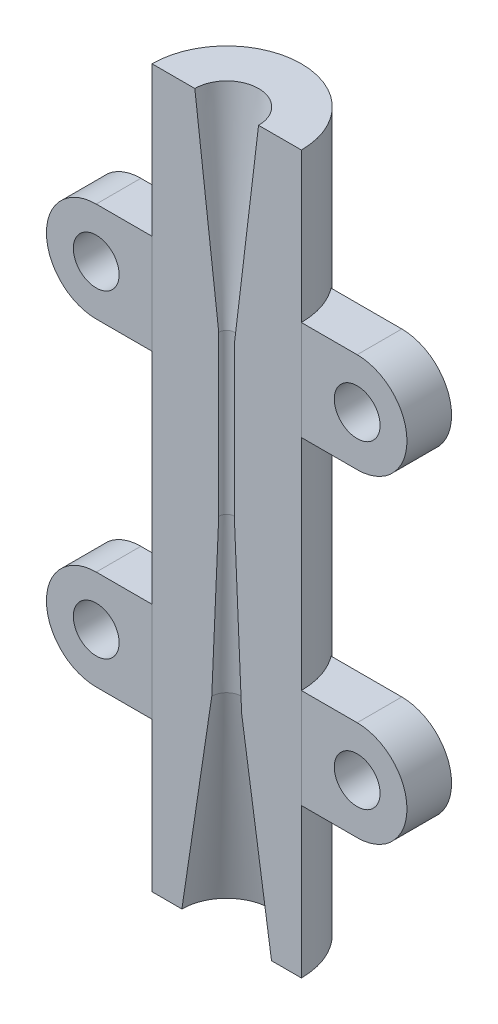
ISO-10303-21;
HEADER;
FILE_DESCRIPTION(('STEP AP214'),'2;1');
FILE_NAME('part.step','',(''),(''),'','','');
FILE_SCHEMA(('AUTOMOTIVE_DESIGN { 1 0 10303 214 1 1 1 1 }'));
ENDSEC;
DATA;
#1=APPLICATION_CONTEXT('core data for automotive mechanical design processes');
#2=APPLICATION_PROTOCOL_DEFINITION('international standard','automotive_design',2000,#1);
#3=PRODUCT_CONTEXT('',#1,'mechanical');
#4=PRODUCT('Part','Part','',(#3));
#5=PRODUCT_RELATED_PRODUCT_CATEGORY('part','',(#4));
#6=PRODUCT_DEFINITION_FORMATION('','',#4);
#7=PRODUCT_DEFINITION_CONTEXT('part definition',#1,'design');
#8=PRODUCT_DEFINITION('design','',#6,#7);
#9=PRODUCT_DEFINITION_SHAPE('','',#8);
#10=(LENGTH_UNIT() NAMED_UNIT(*) SI_UNIT(.MILLI.,.METRE.));
#11=(NAMED_UNIT(*) PLANE_ANGLE_UNIT() SI_UNIT($,.RADIAN.));
#12=(NAMED_UNIT(*) SI_UNIT($,.STERADIAN.) SOLID_ANGLE_UNIT());
#13=UNCERTAINTY_MEASURE_WITH_UNIT(LENGTH_MEASURE(1.E-05),#10,'distance_accuracy_value','');
#14=(GEOMETRIC_REPRESENTATION_CONTEXT(3) GLOBAL_UNCERTAINTY_ASSIGNED_CONTEXT((#13)) GLOBAL_UNIT_ASSIGNED_CONTEXT((#10,
#11,#12)) REPRESENTATION_CONTEXT('',''));
#15=CARTESIAN_POINT('',(0.,0.,0.));
#16=DIRECTION('',(0.,0.,1.));
#17=DIRECTION('',(1.,0.,0.));
#18=AXIS2_PLACEMENT_3D('',#15,#16,#17);
#19=CARTESIAN_POINT('',(0.,-10.5,-2.24));
#20=DIRECTION('',(0.,1.,0.));
#21=DIRECTION('',(0.,0.,1.));
#22=AXIS2_PLACEMENT_3D('',#19,#20,#21);
#23=PLANE('',#22);
#24=DIRECTION('',(-1.,0.,0.));
#25=VECTOR('',#24,1.);
#26=CARTESIAN_POINT('',(0.,-10.5,0.));
#27=LINE('',#26,#25);
#28=CARTESIAN_POINT('',(-1.85,-10.5,0.));
#29=VERTEX_POINT('',#28);
#30=CARTESIAN_POINT('',(-6.15026637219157,-10.5,0.));
#31=VERTEX_POINT('',#30);
#32=EDGE_CURVE('E114',#29,#31,#27,.T.);
#33=ORIENTED_EDGE('',*,*,#32,.T.);
#34=DIRECTION('',(0.,0.,1.));
#35=VECTOR('',#34,1.);
#36=CARTESIAN_POINT('',(-6.15026637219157,-10.5,-2.24));
#37=LINE('',#36,#35);
#38=CARTESIAN_POINT('',(-6.15026637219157,-10.5,-2.24));
#39=VERTEX_POINT('',#38);
#40=EDGE_CURVE('E12',#39,#31,#37,.T.);
#41=ORIENTED_EDGE('',*,*,#40,.F.);
#42=DIRECTION('',(-1.,0.,0.));
#43=VECTOR('',#42,1.);
#44=CARTESIAN_POINT('',(0.,-10.5,-2.24));
#45=LINE('',#44,#43);
#46=CARTESIAN_POINT('',(-1.85,-10.5,-2.24));
#47=VERTEX_POINT('',#46);
#48=EDGE_CURVE('E65',#47,#39,#45,.T.);
#49=ORIENTED_EDGE('',*,*,#48,.F.);
#50=DIRECTION('',(0.,0.,1.));
#51=VECTOR('',#50,1.);
#52=CARTESIAN_POINT('',(-1.85,-10.5,-2.24));
#53=LINE('',#52,#51);
#54=EDGE_CURVE('E50',#47,#29,#53,.T.);
#55=ORIENTED_EDGE('',*,*,#54,.T.);
#56=EDGE_LOOP('',(#33,#41,#49,#55));
#57=FACE_BOUND('',#56,.T.);
#58=ADVANCED_FACE('F47',(#57),#23,.F.);
#59=CARTESIAN_POINT('',(-6.15026637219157,-8.,-2.24));
#60=DIRECTION('',(0.,0.,1.));
#61=DIRECTION('',(1.,0.,0.));
#62=AXIS2_PLACEMENT_3D('',#59,#60,#61);
#63=CYLINDRICAL_SURFACE('',#62,2.5);
#64=CARTESIAN_POINT('',(-6.15026637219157,-8.,0.));
#65=DIRECTION('',(0.,0.,1.));
#66=DIRECTION('',(1.,0.,0.));
#67=AXIS2_PLACEMENT_3D('',#64,#65,#66);
#68=CIRCLE('',#67,2.5);
#69=CARTESIAN_POINT('',(-6.15026637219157,-5.5,0.));
#70=VERTEX_POINT('',#69);
#71=EDGE_CURVE('E119',#70,#31,#68,.T.);
#72=ORIENTED_EDGE('',*,*,#71,.F.);
#73=DIRECTION('',(0.,0.,1.));
#74=VECTOR('',#73,1.);
#75=CARTESIAN_POINT('',(-6.15026637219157,-5.5,-2.24));
#76=LINE('',#75,#74);
#77=CARTESIAN_POINT('',(-6.15026637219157,-5.5,-2.24));
#78=VERTEX_POINT('',#77);
#79=EDGE_CURVE('E56',#78,#70,#76,.T.);
#80=ORIENTED_EDGE('',*,*,#79,.F.);
#81=CARTESIAN_POINT('',(-6.15026637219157,-8.,-2.24));
#82=DIRECTION('',(0.,0.,1.));
#83=DIRECTION('',(1.,0.,0.));
#84=AXIS2_PLACEMENT_3D('',#81,#82,#83);
#85=CIRCLE('',#84,2.5);
#86=EDGE_CURVE('E96',#78,#39,#85,.T.);
#87=ORIENTED_EDGE('',*,*,#86,.T.);
#88=ORIENTED_EDGE('',*,*,#40,.T.);
#89=EDGE_LOOP('',(#72,#80,#87,#88));
#90=FACE_BOUND('',#89,.T.);
#91=ADVANCED_FACE('F139',(#90),#63,.T.);
#92=CARTESIAN_POINT('',(0.,-5.5,-2.24));
#93=DIRECTION('',(0.,-1.,0.));
#94=DIRECTION('',(0.,0.,-1.));
#95=AXIS2_PLACEMENT_3D('',#92,#93,#94);
#96=PLANE('',#95);
#97=DIRECTION('',(1.,0.,0.));
#98=VECTOR('',#97,1.);
#99=CARTESIAN_POINT('',(0.,-5.5,0.));
#100=LINE('',#99,#98);
#101=CARTESIAN_POINT('',(-1.85,-5.5,0.));
#102=VERTEX_POINT('',#101);
#103=EDGE_CURVE('E101',#70,#102,#100,.T.);
#104=ORIENTED_EDGE('',*,*,#103,.T.);
#105=DIRECTION('',(0.,0.,1.));
#106=VECTOR('',#105,1.);
#107=CARTESIAN_POINT('',(-1.85,-5.5,-2.24));
#108=LINE('',#107,#106);
#109=CARTESIAN_POINT('',(-1.85,-5.5,-2.24));
#110=VERTEX_POINT('',#109);
#111=EDGE_CURVE('E99',#110,#102,#108,.T.);
#112=ORIENTED_EDGE('',*,*,#111,.F.);
#113=DIRECTION('',(1.,0.,0.));
#114=VECTOR('',#113,1.);
#115=CARTESIAN_POINT('',(0.,-5.5,-2.24));
#116=LINE('',#115,#114);
#117=EDGE_CURVE('E92',#78,#110,#116,.T.);
#118=ORIENTED_EDGE('',*,*,#117,.F.);
#119=ORIENTED_EDGE('',*,*,#79,.T.);
#120=EDGE_LOOP('',(#104,#112,#118,#119));
#121=FACE_BOUND('',#120,.T.);
#122=ADVANCED_FACE('F100',(#121),#96,.F.);
#123=CARTESIAN_POINT('',(-1.85,0.,-2.24));
#124=DIRECTION('',(-1.,0.,0.));
#125=DIRECTION('',(0.,0.,1.));
#126=AXIS2_PLACEMENT_3D('',#123,#124,#125);
#127=PLANE('',#126);
#128=DIRECTION('',(0.,-1.,0.));
#129=VECTOR('',#128,1.);
#130=CARTESIAN_POINT('',(-1.85,0.,0.));
#131=LINE('',#130,#129);
#132=EDGE_CURVE('E116',#102,#29,#131,.T.);
#133=ORIENTED_EDGE('',*,*,#132,.T.);
#134=ORIENTED_EDGE('',*,*,#54,.F.);
#135=DIRECTION('',(0.,-1.,0.));
#136=VECTOR('',#135,1.);
#137=CARTESIAN_POINT('',(-1.85,0.,-2.24));
#138=LINE('',#137,#136);
#139=EDGE_CURVE('E90',#110,#47,#138,.T.);
#140=ORIENTED_EDGE('',*,*,#139,.F.);
#141=ORIENTED_EDGE('',*,*,#111,.T.);
#142=EDGE_LOOP('',(#133,#134,#140,#141));
#143=FACE_BOUND('',#142,.T.);
#144=ADVANCED_FACE('F104',(#143),#127,.F.);
#145=CARTESIAN_POINT('',(-6.15026637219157,-8.,-2.24));
#146=DIRECTION('',(0.,0.,1.));
#147=DIRECTION('',(1.,0.,0.));
#148=AXIS2_PLACEMENT_3D('',#145,#146,#147);
#149=CYLINDRICAL_SURFACE('',#148,1.15);
#150=CARTESIAN_POINT('',(-6.15026637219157,-8.,-2.24));
#151=DIRECTION('',(0.,0.,1.));
#152=DIRECTION('',(1.,0.,0.));
#153=AXIS2_PLACEMENT_3D('',#150,#151,#152);
#154=CIRCLE('',#153,1.15);
#155=CARTESIAN_POINT('',(-5.00026637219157,-8.,-2.24));
#156=VERTEX_POINT('',#155);
#157=EDGE_CURVE('E111',#156,#156,#154,.T.);
#158=ORIENTED_EDGE('',*,*,#157,.F.);
#159=EDGE_LOOP('',(#158));
#160=FACE_BOUND('',#159,.T.);
#161=CARTESIAN_POINT('',(-6.15026637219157,-8.,0.));
#162=DIRECTION('',(0.,0.,1.));
#163=DIRECTION('',(1.,0.,0.));
#164=AXIS2_PLACEMENT_3D('',#161,#162,#163);
#165=CIRCLE('',#164,1.15);
#166=CARTESIAN_POINT('',(-5.00026637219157,-8.,0.));
#167=VERTEX_POINT('',#166);
#168=EDGE_CURVE('E107',#167,#167,#165,.T.);
#169=ORIENTED_EDGE('',*,*,#168,.T.);
#170=EDGE_LOOP('',(#169));
#171=FACE_BOUND('',#170,.T.);
#172=ADVANCED_FACE('F126',(#160,#171),#149,.F.);
#173=CARTESIAN_POINT('',(0.,0.,-2.24));
#174=DIRECTION('',(0.,0.,1.));
#175=DIRECTION('',(1.,0.,0.));
#176=AXIS2_PLACEMENT_3D('',#173,#174,#175);
#177=PLANE('',#176);
#178=ORIENTED_EDGE('',*,*,#48,.T.);
#179=ORIENTED_EDGE('',*,*,#86,.F.);
#180=ORIENTED_EDGE('',*,*,#117,.T.);
#181=ORIENTED_EDGE('',*,*,#139,.T.);
#182=EDGE_LOOP('',(#178,#179,#180,#181));
#183=FACE_BOUND('',#182,.T.);
#184=ORIENTED_EDGE('',*,*,#157,.T.);
#185=EDGE_LOOP('',(#184));
#186=FACE_BOUND('',#185,.T.);
#187=ADVANCED_FACE('F94',(#183,#186),#177,.F.);
#188=CARTESIAN_POINT('',(0.,0.,0.));
#189=DIRECTION('',(0.,0.,1.));
#190=DIRECTION('',(1.,0.,0.));
#191=AXIS2_PLACEMENT_3D('',#188,#189,#190);
#192=PLANE('',#191);
#193=ORIENTED_EDGE('',*,*,#32,.F.);
#194=ORIENTED_EDGE('',*,*,#132,.F.);
#195=ORIENTED_EDGE('',*,*,#103,.F.);
#196=ORIENTED_EDGE('',*,*,#71,.T.);
#197=EDGE_LOOP('',(#193,#194,#195,#196));
#198=FACE_BOUND('',#197,.T.);
#199=ORIENTED_EDGE('',*,*,#168,.F.);
#200=EDGE_LOOP('',(#199));
#201=FACE_BOUND('',#200,.T.);
#202=ADVANCED_FACE('F128',(#198,#201),#192,.T.);
#203=CLOSED_SHELL('',(#58,#91,#122,#144,#172,#187,#202));
#204=MANIFOLD_SOLID_BREP('B2',#203);
#205=CARTESIAN_POINT('',(0.,-10.5,-2.24));
#206=DIRECTION('',(0.,1.,0.));
#207=DIRECTION('',(0.,0.,1.));
#208=AXIS2_PLACEMENT_3D('',#205,#206,#207);
#209=PLANE('',#208);
#210=DIRECTION('',(-1.,0.,0.));
#211=VECTOR('',#210,1.);
#212=CARTESIAN_POINT('',(0.,-10.5,0.));
#213=LINE('',#212,#211);
#214=CARTESIAN_POINT('',(6.95,-10.5,0.));
#215=VERTEX_POINT('',#214);
#216=CARTESIAN_POINT('',(2.65,-10.5,0.));
#217=VERTEX_POINT('',#216);
#218=EDGE_CURVE('E286',#215,#217,#213,.T.);
#219=ORIENTED_EDGE('',*,*,#218,.T.);
#220=DIRECTION('',(0.,0.,1.));
#221=VECTOR('',#220,1.);
#222=CARTESIAN_POINT('',(2.65,-10.5,-2.24));
#223=LINE('',#222,#221);
#224=CARTESIAN_POINT('',(2.65,-10.5,-2.24));
#225=VERTEX_POINT('',#224);
#226=EDGE_CURVE('E45',#225,#217,#223,.T.);
#227=ORIENTED_EDGE('',*,*,#226,.F.);
#228=DIRECTION('',(-1.,0.,0.));
#229=VECTOR('',#228,1.);
#230=CARTESIAN_POINT('',(0.,-10.5,-2.24));
#231=LINE('',#230,#229);
#232=CARTESIAN_POINT('',(6.95,-10.5,-2.24));
#233=VERTEX_POINT('',#232);
#234=EDGE_CURVE('E237',#233,#225,#231,.T.);
#235=ORIENTED_EDGE('',*,*,#234,.F.);
#236=DIRECTION('',(0.,0.,1.));
#237=VECTOR('',#236,1.);
#238=CARTESIAN_POINT('',(6.95,-10.5,-2.24));
#239=LINE('',#238,#237);
#240=EDGE_CURVE('E222',#233,#215,#239,.T.);
#241=ORIENTED_EDGE('',*,*,#240,.T.);
#242=EDGE_LOOP('',(#219,#227,#235,#241));
#243=FACE_BOUND('',#242,.T.);
#244=ADVANCED_FACE('F219',(#243),#209,.F.);
#245=CARTESIAN_POINT('',(2.65,0.,-2.24));
#246=DIRECTION('',(-1.,0.,0.));
#247=DIRECTION('',(0.,-1.,0.));
#248=AXIS2_PLACEMENT_3D('',#245,#246,#247);
#249=PLANE('',#248);
#250=DIRECTION('',(0.,-1.,0.));
#251=VECTOR('',#250,1.);
#252=CARTESIAN_POINT('',(2.65,0.,0.));
#253=LINE('',#252,#251);
#254=CARTESIAN_POINT('',(2.65,-5.5,0.));
#255=VERTEX_POINT('',#254);
#256=EDGE_CURVE('E291',#255,#217,#253,.T.);
#257=ORIENTED_EDGE('',*,*,#256,.F.);
#258=DIRECTION('',(0.,0.,1.));
#259=VECTOR('',#258,1.);
#260=CARTESIAN_POINT('',(2.65,-5.5,-2.24));
#261=LINE('',#260,#259);
#262=CARTESIAN_POINT('',(2.65,-5.5,-2.24));
#263=VERTEX_POINT('',#262);
#264=EDGE_CURVE('E228',#263,#255,#261,.T.);
#265=ORIENTED_EDGE('',*,*,#264,.F.);
#266=DIRECTION('',(0.,-1.,0.));
#267=VECTOR('',#266,1.);
#268=CARTESIAN_POINT('',(2.65,0.,-2.24));
#269=LINE('',#268,#267);
#270=EDGE_CURVE('E275',#263,#225,#269,.T.);
#271=ORIENTED_EDGE('',*,*,#270,.T.);
#272=ORIENTED_EDGE('',*,*,#226,.T.);
#273=EDGE_LOOP('',(#257,#265,#271,#272));
#274=FACE_BOUND('',#273,.T.);
#275=ADVANCED_FACE('F311',(#274),#249,.T.);
#276=CARTESIAN_POINT('',(0.,-5.5,-2.24));
#277=DIRECTION('',(0.,1.,0.));
#278=DIRECTION('',(0.,0.,1.));
#279=AXIS2_PLACEMENT_3D('',#276,#277,#278);
#280=PLANE('',#279);
#281=DIRECTION('',(-1.,0.,0.));
#282=VECTOR('',#281,1.);
#283=CARTESIAN_POINT('',(0.,-5.5,0.));
#284=LINE('',#283,#282);
#285=CARTESIAN_POINT('',(6.95,-5.5,0.));
#286=VERTEX_POINT('',#285);
#287=EDGE_CURVE('E270',#286,#255,#284,.T.);
#288=ORIENTED_EDGE('',*,*,#287,.F.);
#289=DIRECTION('',(0.,0.,1.));
#290=VECTOR('',#289,1.);
#291=CARTESIAN_POINT('',(6.95,-5.5,-2.24));
#292=LINE('',#291,#290);
#293=CARTESIAN_POINT('',(6.95,-5.5,-2.24));
#294=VERTEX_POINT('',#293);
#295=EDGE_CURVE('E266',#294,#286,#292,.T.);
#296=ORIENTED_EDGE('',*,*,#295,.F.);
#297=DIRECTION('',(-1.,0.,0.));
#298=VECTOR('',#297,1.);
#299=CARTESIAN_POINT('',(0.,-5.5,-2.24));
#300=LINE('',#299,#298);
#301=EDGE_CURVE('E269',#294,#263,#300,.T.);
#302=ORIENTED_EDGE('',*,*,#301,.T.);
#303=ORIENTED_EDGE('',*,*,#264,.T.);
#304=EDGE_LOOP('',(#288,#296,#302,#303));
#305=FACE_BOUND('',#304,.T.);
#306=ADVANCED_FACE('F268',(#305),#280,.T.);
#307=CARTESIAN_POINT('',(6.95,-8.,-2.24));
#308=DIRECTION('',(0.,0.,1.));
#309=DIRECTION('',(1.,0.,0.));
#310=AXIS2_PLACEMENT_3D('',#307,#308,#309);
#311=CYLINDRICAL_SURFACE('',#310,2.5);
#312=CARTESIAN_POINT('',(6.95,-8.,0.));
#313=DIRECTION('',(0.,0.,1.));
#314=DIRECTION('',(1.,0.,0.));
#315=AXIS2_PLACEMENT_3D('',#312,#313,#314);
#316=CIRCLE('',#315,2.5);
#317=EDGE_CURVE('E288',#215,#286,#316,.T.);
#318=ORIENTED_EDGE('',*,*,#317,.F.);
#319=ORIENTED_EDGE('',*,*,#240,.F.);
#320=CARTESIAN_POINT('',(6.95,-8.,-2.24));
#321=DIRECTION('',(0.,0.,1.));
#322=DIRECTION('',(1.,0.,0.));
#323=AXIS2_PLACEMENT_3D('',#320,#321,#322);
#324=CIRCLE('',#323,2.5);
#325=EDGE_CURVE('E274',#233,#294,#324,.T.);
#326=ORIENTED_EDGE('',*,*,#325,.T.);
#327=ORIENTED_EDGE('',*,*,#295,.T.);
#328=EDGE_LOOP('',(#318,#319,#326,#327));
#329=FACE_BOUND('',#328,.T.);
#330=ADVANCED_FACE('F277',(#329),#311,.T.);
#331=CARTESIAN_POINT('',(6.95,-8.,-2.24));
#332=DIRECTION('',(0.,0.,1.));
#333=DIRECTION('',(1.,0.,0.));
#334=AXIS2_PLACEMENT_3D('',#331,#332,#333);
#335=CYLINDRICAL_SURFACE('',#334,1.15);
#336=CARTESIAN_POINT('',(6.95,-8.,-2.24));
#337=DIRECTION('',(0.,0.,1.));
#338=DIRECTION('',(1.,0.,0.));
#339=AXIS2_PLACEMENT_3D('',#336,#337,#338);
#340=CIRCLE('',#339,1.15);
#341=CARTESIAN_POINT('',(8.1,-8.,-2.24));
#342=VERTEX_POINT('',#341);
#343=EDGE_CURVE('E283',#342,#342,#340,.T.);
#344=ORIENTED_EDGE('',*,*,#343,.F.);
#345=EDGE_LOOP('',(#344));
#346=FACE_BOUND('',#345,.T.);
#347=CARTESIAN_POINT('',(6.95,-8.,0.));
#348=DIRECTION('',(0.,0.,1.));
#349=DIRECTION('',(1.,0.,0.));
#350=AXIS2_PLACEMENT_3D('',#347,#348,#349);
#351=CIRCLE('',#350,1.15);
#352=CARTESIAN_POINT('',(8.1,-8.,0.));
#353=VERTEX_POINT('',#352);
#354=EDGE_CURVE('E279',#353,#353,#351,.T.);
#355=ORIENTED_EDGE('',*,*,#354,.T.);
#356=EDGE_LOOP('',(#355));
#357=FACE_BOUND('',#356,.T.);
#358=ADVANCED_FACE('F298',(#346,#357),#335,.F.);
#359=CARTESIAN_POINT('',(0.,0.,-2.24));
#360=DIRECTION('',(0.,0.,1.));
#361=DIRECTION('',(1.,0.,0.));
#362=AXIS2_PLACEMENT_3D('',#359,#360,#361);
#363=PLANE('',#362);
#364=ORIENTED_EDGE('',*,*,#234,.T.);
#365=ORIENTED_EDGE('',*,*,#270,.F.);
#366=ORIENTED_EDGE('',*,*,#301,.F.);
#367=ORIENTED_EDGE('',*,*,#325,.F.);
#368=EDGE_LOOP('',(#364,#365,#366,#367));
#369=FACE_BOUND('',#368,.T.);
#370=ORIENTED_EDGE('',*,*,#343,.T.);
#371=EDGE_LOOP('',(#370));
#372=FACE_BOUND('',#371,.T.);
#373=ADVANCED_FACE('F272',(#369,#372),#363,.F.);
#374=CARTESIAN_POINT('',(0.,0.,0.));
#375=DIRECTION('',(0.,0.,1.));
#376=DIRECTION('',(1.,0.,0.));
#377=AXIS2_PLACEMENT_3D('',#374,#375,#376);
#378=PLANE('',#377);
#379=ORIENTED_EDGE('',*,*,#218,.F.);
#380=ORIENTED_EDGE('',*,*,#317,.T.);
#381=ORIENTED_EDGE('',*,*,#287,.T.);
#382=ORIENTED_EDGE('',*,*,#256,.T.);
#383=EDGE_LOOP('',(#379,#380,#381,#382));
#384=FACE_BOUND('',#383,.T.);
#385=ORIENTED_EDGE('',*,*,#354,.F.);
#386=EDGE_LOOP('',(#385));
#387=FACE_BOUND('',#386,.T.);
#388=ADVANCED_FACE('F300',(#384,#387),#378,.T.);
#389=CLOSED_SHELL('',(#244,#275,#306,#330,#358,#373,#388));
#390=MANIFOLD_SOLID_BREP('B6',#389);
#391=CARTESIAN_POINT('',(6.95,8.,-2.24));
#392=DIRECTION('',(0.,0.,1.));
#393=DIRECTION('',(1.,0.,0.));
#394=AXIS2_PLACEMENT_3D('',#391,#392,#393);
#395=CYLINDRICAL_SURFACE('',#394,2.5);
#396=CARTESIAN_POINT('',(6.95,8.,0.));
#397=DIRECTION('',(0.,0.,1.));
#398=DIRECTION('',(1.,0.,0.));
#399=AXIS2_PLACEMENT_3D('',#396,#397,#398);
#400=CIRCLE('',#399,2.5);
#401=CARTESIAN_POINT('',(6.95,5.5,0.));
#402=VERTEX_POINT('',#401);
#403=CARTESIAN_POINT('',(6.95,10.5,0.));
#404=VERTEX_POINT('',#403);
#405=EDGE_CURVE('E461',#402,#404,#400,.T.);
#406=ORIENTED_EDGE('',*,*,#405,.F.);
#407=DIRECTION('',(0.,0.,1.));
#408=VECTOR('',#407,1.);
#409=CARTESIAN_POINT('',(6.95,5.5,-2.24));
#410=LINE('',#409,#408);
#411=CARTESIAN_POINT('',(6.95,5.5,-2.24));
#412=VERTEX_POINT('',#411);
#413=EDGE_CURVE('E217',#412,#402,#410,.T.);
#414=ORIENTED_EDGE('',*,*,#413,.F.);
#415=CARTESIAN_POINT('',(6.95,8.,-2.24));
#416=DIRECTION('',(0.,0.,1.));
#417=DIRECTION('',(1.,0.,0.));
#418=AXIS2_PLACEMENT_3D('',#415,#416,#417);
#419=CIRCLE('',#418,2.5);
#420=CARTESIAN_POINT('',(6.95,10.5,-2.24));
#421=VERTEX_POINT('',#420);
#422=EDGE_CURVE('E451',#412,#421,#419,.T.);
#423=ORIENTED_EDGE('',*,*,#422,.T.);
#424=DIRECTION('',(0.,0.,1.));
#425=VECTOR('',#424,1.);
#426=CARTESIAN_POINT('',(6.95,10.5,-2.24));
#427=LINE('',#426,#425);
#428=EDGE_CURVE('E395',#421,#404,#427,.T.);
#429=ORIENTED_EDGE('',*,*,#428,.T.);
#430=EDGE_LOOP('',(#406,#414,#423,#429));
#431=FACE_BOUND('',#430,.T.);
#432=ADVANCED_FACE('F391',(#431),#395,.T.);
#433=CARTESIAN_POINT('',(0.,5.5,-2.24));
#434=DIRECTION('',(0.,1.,0.));
#435=DIRECTION('',(-1.,0.,0.));
#436=AXIS2_PLACEMENT_3D('',#433,#434,#435);
#437=PLANE('',#436);
#438=DIRECTION('',(-1.,0.,0.));
#439=VECTOR('',#438,1.);
#440=CARTESIAN_POINT('',(0.,5.5,0.));
#441=LINE('',#440,#439);
#442=CARTESIAN_POINT('',(2.65,5.5,0.));
#443=VERTEX_POINT('',#442);
#444=EDGE_CURVE('E467',#402,#443,#441,.T.);
#445=ORIENTED_EDGE('',*,*,#444,.T.);
#446=DIRECTION('',(0.,0.,1.));
#447=VECTOR('',#446,1.);
#448=CARTESIAN_POINT('',(2.65,5.5,-2.24));
#449=LINE('',#448,#447);
#450=CARTESIAN_POINT('',(2.65,5.5,-2.24));
#451=VERTEX_POINT('',#450);
#452=EDGE_CURVE('E401',#451,#443,#449,.T.);
#453=ORIENTED_EDGE('',*,*,#452,.F.);
#454=DIRECTION('',(-1.,0.,0.));
#455=VECTOR('',#454,1.);
#456=CARTESIAN_POINT('',(0.,5.5,-2.24));
#457=LINE('',#456,#455);
#458=EDGE_CURVE('E448',#412,#451,#457,.T.);
#459=ORIENTED_EDGE('',*,*,#458,.F.);
#460=ORIENTED_EDGE('',*,*,#413,.T.);
#461=EDGE_LOOP('',(#445,#453,#459,#460));
#462=FACE_BOUND('',#461,.T.);
#463=ADVANCED_FACE('F482',(#462),#437,.F.);
#464=CARTESIAN_POINT('',(2.65,0.,-2.24));
#465=DIRECTION('',(-1.,0.,0.));
#466=DIRECTION('',(0.,-1.,0.));
#467=AXIS2_PLACEMENT_3D('',#464,#465,#466);
#468=PLANE('',#467);
#469=DIRECTION('',(0.,-1.,0.));
#470=VECTOR('',#469,1.);
#471=CARTESIAN_POINT('',(2.65,0.,0.));
#472=LINE('',#471,#470);
#473=CARTESIAN_POINT('',(2.65,10.5,0.));
#474=VERTEX_POINT('',#473);
#475=EDGE_CURVE('E442',#474,#443,#472,.T.);
#476=ORIENTED_EDGE('',*,*,#475,.F.);
#477=DIRECTION('',(0.,0.,1.));
#478=VECTOR('',#477,1.);
#479=CARTESIAN_POINT('',(2.65,10.5,-2.24));
#480=LINE('',#479,#478);
#481=CARTESIAN_POINT('',(2.65,10.5,-2.24));
#482=VERTEX_POINT('',#481);
#483=EDGE_CURVE('E437',#482,#474,#480,.T.);
#484=ORIENTED_EDGE('',*,*,#483,.F.);
#485=DIRECTION('',(0.,-1.,0.));
#486=VECTOR('',#485,1.);
#487=CARTESIAN_POINT('',(2.65,0.,-2.24));
#488=LINE('',#487,#486);
#489=EDGE_CURVE('E440',#482,#451,#488,.T.);
#490=ORIENTED_EDGE('',*,*,#489,.T.);
#491=ORIENTED_EDGE('',*,*,#452,.T.);
#492=EDGE_LOOP('',(#476,#484,#490,#491));
#493=FACE_BOUND('',#492,.T.);
#494=ADVANCED_FACE('F439',(#493),#468,.T.);
#495=CARTESIAN_POINT('',(6.95,8.,-2.24));
#496=DIRECTION('',(0.,0.,1.));
#497=DIRECTION('',(1.,0.,0.));
#498=AXIS2_PLACEMENT_3D('',#495,#496,#497);
#499=CYLINDRICAL_SURFACE('',#498,1.15);
#500=CARTESIAN_POINT('',(6.95,8.,-2.24));
#501=DIRECTION('',(0.,0.,1.));
#502=DIRECTION('',(1.,0.,0.));
#503=AXIS2_PLACEMENT_3D('',#500,#501,#502);
#504=CIRCLE('',#503,1.15);
#505=CARTESIAN_POINT('',(8.1,8.,-2.24));
#506=VERTEX_POINT('',#505);
#507=EDGE_CURVE('E453',#506,#506,#504,.T.);
#508=ORIENTED_EDGE('',*,*,#507,.F.);
#509=EDGE_LOOP('',(#508));
#510=FACE_BOUND('',#509,.T.);
#511=CARTESIAN_POINT('',(6.95,8.,0.));
#512=DIRECTION('',(0.,0.,1.));
#513=DIRECTION('',(1.,0.,0.));
#514=AXIS2_PLACEMENT_3D('',#511,#512,#513);
#515=CIRCLE('',#514,1.15);
#516=CARTESIAN_POINT('',(8.1,8.,0.));
#517=VERTEX_POINT('',#516);
#518=EDGE_CURVE('E458',#517,#517,#515,.T.);
#519=ORIENTED_EDGE('',*,*,#518,.T.);
#520=EDGE_LOOP('',(#519));
#521=FACE_BOUND('',#520,.T.);
#522=ADVANCED_FACE('F393',(#510,#521),#499,.F.);
#523=CARTESIAN_POINT('',(0.,10.5,-2.24));
#524=DIRECTION('',(0.,1.,0.));
#525=DIRECTION('',(0.,0.,1.));
#526=AXIS2_PLACEMENT_3D('',#523,#524,#525);
#527=PLANE('',#526);
#528=DIRECTION('',(-1.,0.,0.));
#529=VECTOR('',#528,1.);
#530=CARTESIAN_POINT('',(0.,10.5,0.));
#531=LINE('',#530,#529);
#532=EDGE_CURVE('E464',#404,#474,#531,.T.);
#533=ORIENTED_EDGE('',*,*,#532,.F.);
#534=ORIENTED_EDGE('',*,*,#428,.F.);
#535=DIRECTION('',(-1.,0.,0.));
#536=VECTOR('',#535,1.);
#537=CARTESIAN_POINT('',(0.,10.5,-2.24));
#538=LINE('',#537,#536);
#539=EDGE_CURVE('E447',#421,#482,#538,.T.);
#540=ORIENTED_EDGE('',*,*,#539,.T.);
#541=ORIENTED_EDGE('',*,*,#483,.T.);
#542=EDGE_LOOP('',(#533,#534,#540,#541));
#543=FACE_BOUND('',#542,.T.);
#544=ADVANCED_FACE('F450',(#543),#527,.T.);
#545=CARTESIAN_POINT('',(0.,0.,-2.24));
#546=DIRECTION('',(0.,0.,1.));
#547=DIRECTION('',(1.,0.,0.));
#548=AXIS2_PLACEMENT_3D('',#545,#546,#547);
#549=PLANE('',#548);
#550=ORIENTED_EDGE('',*,*,#507,.T.);
#551=EDGE_LOOP('',(#550));
#552=FACE_BOUND('',#551,.T.);
#553=ORIENTED_EDGE('',*,*,#422,.F.);
#554=ORIENTED_EDGE('',*,*,#458,.T.);
#555=ORIENTED_EDGE('',*,*,#489,.F.);
#556=ORIENTED_EDGE('',*,*,#539,.F.);
#557=EDGE_LOOP('',(#553,#554,#555,#556));
#558=FACE_BOUND('',#557,.T.);
#559=ADVANCED_FACE('F446',(#552,#558),#549,.F.);
#560=CARTESIAN_POINT('',(0.,0.,0.));
#561=DIRECTION('',(0.,0.,1.));
#562=DIRECTION('',(1.,0.,0.));
#563=AXIS2_PLACEMENT_3D('',#560,#561,#562);
#564=PLANE('',#563);
#565=ORIENTED_EDGE('',*,*,#518,.F.);
#566=EDGE_LOOP('',(#565));
#567=FACE_BOUND('',#566,.T.);
#568=ORIENTED_EDGE('',*,*,#405,.T.);
#569=ORIENTED_EDGE('',*,*,#532,.T.);
#570=ORIENTED_EDGE('',*,*,#475,.T.);
#571=ORIENTED_EDGE('',*,*,#444,.F.);
#572=EDGE_LOOP('',(#568,#569,#570,#571));
#573=FACE_BOUND('',#572,.T.);
#574=ADVANCED_FACE('F477',(#567,#573),#564,.T.);
#575=CLOSED_SHELL('',(#432,#463,#494,#522,#544,#559,#574));
#576=MANIFOLD_SOLID_BREP('B39',#575);
#577=CARTESIAN_POINT('',(0.,10.5,-2.24));
#578=DIRECTION('',(0.,-1.,0.));
#579=DIRECTION('',(1.,0.,0.));
#580=AXIS2_PLACEMENT_3D('',#577,#578,#579);
#581=PLANE('',#580);
#582=DIRECTION('',(1.,0.,0.));
#583=VECTOR('',#582,1.);
#584=CARTESIAN_POINT('',(0.,10.5,0.));
#585=LINE('',#584,#583);
#586=CARTESIAN_POINT('',(-6.15026637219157,10.5,0.));
#587=VERTEX_POINT('',#586);
#588=CARTESIAN_POINT('',(-1.85,10.5,0.));
#589=VERTEX_POINT('',#588);
#590=EDGE_CURVE('E631',#587,#589,#585,.T.);
#591=ORIENTED_EDGE('',*,*,#590,.T.);
#592=DIRECTION('',(0.,0.,1.));
#593=VECTOR('',#592,1.);
#594=CARTESIAN_POINT('',(-1.85,10.5,-2.24));
#595=LINE('',#594,#593);
#596=CARTESIAN_POINT('',(-1.85,10.5,-2.24));
#597=VERTEX_POINT('',#596);
#598=EDGE_CURVE('E389',#597,#589,#595,.T.);
#599=ORIENTED_EDGE('',*,*,#598,.F.);
#600=DIRECTION('',(1.,0.,0.));
#601=VECTOR('',#600,1.);
#602=CARTESIAN_POINT('',(0.,10.5,-2.24));
#603=LINE('',#602,#601);
#604=CARTESIAN_POINT('',(-6.15026637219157,10.5,-2.24));
#605=VERTEX_POINT('',#604);
#606=EDGE_CURVE('E622',#605,#597,#603,.T.);
#607=ORIENTED_EDGE('',*,*,#606,.F.);
#608=DIRECTION('',(0.,0.,1.));
#609=VECTOR('',#608,1.);
#610=CARTESIAN_POINT('',(-6.15026637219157,10.5,-2.24));
#611=LINE('',#610,#609);
#612=EDGE_CURVE('E565',#605,#587,#611,.T.);
#613=ORIENTED_EDGE('',*,*,#612,.T.);
#614=EDGE_LOOP('',(#591,#599,#607,#613));
#615=FACE_BOUND('',#614,.T.);
#616=ADVANCED_FACE('F562',(#615),#581,.F.);
#617=CARTESIAN_POINT('',(-1.85,0.,-2.24));
#618=DIRECTION('',(-1.,0.,0.));
#619=DIRECTION('',(0.,-1.,0.));
#620=AXIS2_PLACEMENT_3D('',#617,#618,#619);
#621=PLANE('',#620);
#622=DIRECTION('',(0.,-1.,0.));
#623=VECTOR('',#622,1.);
#624=CARTESIAN_POINT('',(-1.85,0.,0.));
#625=LINE('',#624,#623);
#626=CARTESIAN_POINT('',(-1.85,5.5,0.));
#627=VERTEX_POINT('',#626);
#628=EDGE_CURVE('E601',#589,#627,#625,.T.);
#629=ORIENTED_EDGE('',*,*,#628,.T.);
#630=DIRECTION('',(0.,0.,1.));
#631=VECTOR('',#630,1.);
#632=CARTESIAN_POINT('',(-1.85,5.5,-2.24));
#633=LINE('',#632,#631);
#634=CARTESIAN_POINT('',(-1.85,5.5,-2.24));
#635=VERTEX_POINT('',#634);
#636=EDGE_CURVE('E571',#635,#627,#633,.T.);
#637=ORIENTED_EDGE('',*,*,#636,.F.);
#638=DIRECTION('',(0.,-1.,0.));
#639=VECTOR('',#638,1.);
#640=CARTESIAN_POINT('',(-1.85,0.,-2.24));
#641=LINE('',#640,#639);
#642=EDGE_CURVE('E579',#597,#635,#641,.T.);
#643=ORIENTED_EDGE('',*,*,#642,.F.);
#644=ORIENTED_EDGE('',*,*,#598,.T.);
#645=EDGE_LOOP('',(#629,#637,#643,#644));
#646=FACE_BOUND('',#645,.T.);
#647=ADVANCED_FACE('F653',(#646),#621,.F.);
#648=CARTESIAN_POINT('',(0.,5.5,-2.24));
#649=DIRECTION('',(0.,-1.,0.));
#650=DIRECTION('',(1.,0.,0.));
#651=AXIS2_PLACEMENT_3D('',#648,#649,#650);
#652=PLANE('',#651);
#653=DIRECTION('',(1.,0.,0.));
#654=VECTOR('',#653,1.);
#655=CARTESIAN_POINT('',(0.,5.5,0.));
#656=LINE('',#655,#654);
#657=CARTESIAN_POINT('',(-6.15026637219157,5.5,0.));
#658=VERTEX_POINT('',#657);
#659=EDGE_CURVE('E613',#658,#627,#656,.T.);
#660=ORIENTED_EDGE('',*,*,#659,.F.);
#661=DIRECTION('',(0.,0.,1.));
#662=VECTOR('',#661,1.);
#663=CARTESIAN_POINT('',(-6.15026637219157,5.5,-2.24));
#664=LINE('',#663,#662);
#665=CARTESIAN_POINT('',(-6.15026637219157,5.5,-2.24));
#666=VERTEX_POINT('',#665);
#667=EDGE_CURVE('E609',#666,#658,#664,.T.);
#668=ORIENTED_EDGE('',*,*,#667,.F.);
#669=DIRECTION('',(1.,0.,0.));
#670=VECTOR('',#669,1.);
#671=CARTESIAN_POINT('',(0.,5.5,-2.24));
#672=LINE('',#671,#670);
#673=EDGE_CURVE('E612',#666,#635,#672,.T.);
#674=ORIENTED_EDGE('',*,*,#673,.T.);
#675=ORIENTED_EDGE('',*,*,#636,.T.);
#676=EDGE_LOOP('',(#660,#668,#674,#675));
#677=FACE_BOUND('',#676,.T.);
#678=ADVANCED_FACE('F611',(#677),#652,.T.);
#679=CARTESIAN_POINT('',(-6.15026637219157,8.,-2.24));
#680=DIRECTION('',(0.,0.,1.));
#681=DIRECTION('',(1.,0.,0.));
#682=AXIS2_PLACEMENT_3D('',#679,#680,#681);
#683=CYLINDRICAL_SURFACE('',#682,2.5);
#684=CARTESIAN_POINT('',(-6.15026637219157,8.,0.));
#685=DIRECTION('',(0.,0.,1.));
#686=DIRECTION('',(1.,0.,0.));
#687=AXIS2_PLACEMENT_3D('',#684,#685,#686);
#688=CIRCLE('',#687,2.5);
#689=EDGE_CURVE('E634',#587,#658,#688,.T.);
#690=ORIENTED_EDGE('',*,*,#689,.F.);
#691=ORIENTED_EDGE('',*,*,#612,.F.);
#692=CARTESIAN_POINT('',(-6.15026637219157,8.,-2.24));
#693=DIRECTION('',(0.,0.,1.));
#694=DIRECTION('',(1.,0.,0.));
#695=AXIS2_PLACEMENT_3D('',#692,#693,#694);
#696=CIRCLE('',#695,2.5);
#697=EDGE_CURVE('E619',#605,#666,#696,.T.);
#698=ORIENTED_EDGE('',*,*,#697,.T.);
#699=ORIENTED_EDGE('',*,*,#667,.T.);
#700=EDGE_LOOP('',(#690,#691,#698,#699));
#701=FACE_BOUND('',#700,.T.);
#702=ADVANCED_FACE('F621',(#701),#683,.T.);
#703=CARTESIAN_POINT('',(-6.15026637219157,8.,-2.24));
#704=DIRECTION('',(0.,0.,1.));
#705=DIRECTION('',(1.,0.,0.));
#706=AXIS2_PLACEMENT_3D('',#703,#704,#705);
#707=CYLINDRICAL_SURFACE('',#706,1.15);
#708=CARTESIAN_POINT('',(-6.15026637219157,8.,-2.24));
#709=DIRECTION('',(0.,0.,1.));
#710=DIRECTION('',(1.,0.,0.));
#711=AXIS2_PLACEMENT_3D('',#708,#709,#710);
#712=CIRCLE('',#711,1.15);
#713=CARTESIAN_POINT('',(-5.00026637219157,8.,-2.24));
#714=VERTEX_POINT('',#713);
#715=EDGE_CURVE('E628',#714,#714,#712,.T.);
#716=ORIENTED_EDGE('',*,*,#715,.F.);
#717=EDGE_LOOP('',(#716));
#718=FACE_BOUND('',#717,.T.);
#719=CARTESIAN_POINT('',(-6.15026637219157,8.,0.));
#720=DIRECTION('',(0.,0.,1.));
#721=DIRECTION('',(1.,0.,0.));
#722=AXIS2_PLACEMENT_3D('',#719,#720,#721);
#723=CIRCLE('',#722,1.15);
#724=CARTESIAN_POINT('',(-5.00026637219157,8.,0.));
#725=VERTEX_POINT('',#724);
#726=EDGE_CURVE('E624',#725,#725,#723,.T.);
#727=ORIENTED_EDGE('',*,*,#726,.T.);
#728=EDGE_LOOP('',(#727));
#729=FACE_BOUND('',#728,.T.);
#730=ADVANCED_FACE('F642',(#718,#729),#707,.F.);
#731=CARTESIAN_POINT('',(0.,0.,-2.24));
#732=DIRECTION('',(0.,0.,1.));
#733=DIRECTION('',(1.,0.,0.));
#734=AXIS2_PLACEMENT_3D('',#731,#732,#733);
#735=PLANE('',#734);
#736=ORIENTED_EDGE('',*,*,#606,.T.);
#737=ORIENTED_EDGE('',*,*,#642,.T.);
#738=ORIENTED_EDGE('',*,*,#673,.F.);
#739=ORIENTED_EDGE('',*,*,#697,.F.);
#740=EDGE_LOOP('',(#736,#737,#738,#739));
#741=FACE_BOUND('',#740,.T.);
#742=ORIENTED_EDGE('',*,*,#715,.T.);
#743=EDGE_LOOP('',(#742));
#744=FACE_BOUND('',#743,.T.);
#745=ADVANCED_FACE('F617',(#741,#744),#735,.F.);
#746=CARTESIAN_POINT('',(0.,0.,0.));
#747=DIRECTION('',(0.,0.,1.));
#748=DIRECTION('',(1.,0.,0.));
#749=AXIS2_PLACEMENT_3D('',#746,#747,#748);
#750=PLANE('',#749);
#751=ORIENTED_EDGE('',*,*,#590,.F.);
#752=ORIENTED_EDGE('',*,*,#689,.T.);
#753=ORIENTED_EDGE('',*,*,#659,.T.);
#754=ORIENTED_EDGE('',*,*,#628,.F.);
#755=EDGE_LOOP('',(#751,#752,#753,#754));
#756=FACE_BOUND('',#755,.T.);
#757=ORIENTED_EDGE('',*,*,#726,.F.);
#758=EDGE_LOOP('',(#757));
#759=FACE_BOUND('',#758,.T.);
#760=ADVANCED_FACE('F644',(#756,#759),#750,.T.);
#761=CLOSED_SHELL('',(#616,#647,#678,#702,#730,#745,#760));
#762=MANIFOLD_SOLID_BREP('B211',#761);
#763=CARTESIAN_POINT('',(0.799999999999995,18.,0.));
#764=DIRECTION('',(0.,-1.,0.));
#765=DIRECTION('',(1.,0.,0.));
#766=AXIS2_PLACEMENT_3D('',#763,#764,#765);
#767=PLANE('',#766);
#768=CARTESIAN_POINT('',(0.399999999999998,18.,0.));
#769=DIRECTION('',(0.,1.,0.));
#770=DIRECTION('',(-1.,0.,0.));
#771=AXIS2_PLACEMENT_3D('',#768,#769,#770);
#772=CIRCLE('',#771,3.75);
#773=CARTESIAN_POINT('',(4.14999999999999,18.,0.));
#774=VERTEX_POINT('',#773);
#775=CARTESIAN_POINT('',(-3.35,18.,0.));
#776=VERTEX_POINT('',#775);
#777=EDGE_CURVE('E560',#774,#776,#772,.T.);
#778=ORIENTED_EDGE('',*,*,#777,.T.);
#779=DIRECTION('',(1.,0.,0.));
#780=VECTOR('',#779,1.);
#781=CARTESIAN_POINT('',(0.,18.,0.));
#782=LINE('',#781,#780);
#783=CARTESIAN_POINT('',(-1.2,18.,0.));
#784=VERTEX_POINT('',#783);
#785=EDGE_CURVE('E782',#776,#784,#782,.T.);
#786=ORIENTED_EDGE('',*,*,#785,.T.);
#787=CARTESIAN_POINT('',(0.399999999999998,18.,0.));
#788=DIRECTION('',(0.,1.,0.));
#789=DIRECTION('',(-1.,0.,0.));
#790=AXIS2_PLACEMENT_3D('',#787,#788,#789);
#791=CIRCLE('',#790,1.6);
#792=CARTESIAN_POINT('',(2.,18.,0.));
#793=VERTEX_POINT('',#792);
#794=EDGE_CURVE('E739',#793,#784,#791,.T.);
#795=ORIENTED_EDGE('',*,*,#794,.F.);
#796=DIRECTION('',(-1.,0.,0.));
#797=VECTOR('',#796,1.);
#798=CARTESIAN_POINT('',(0.799999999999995,18.,0.));
#799=LINE('',#798,#797);
#800=EDGE_CURVE('E784',#774,#793,#799,.T.);
#801=ORIENTED_EDGE('',*,*,#800,.F.);
#802=EDGE_LOOP('',(#778,#786,#795,#801));
#803=FACE_BOUND('',#802,.T.);
#804=ADVANCED_FACE('F724',(#803),#767,.F.);
#805=CARTESIAN_POINT('',(0.399999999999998,18.,0.));
#806=DIRECTION('',(0.,1.,0.));
#807=DIRECTION('',(-1.,0.,0.));
#808=AXIS2_PLACEMENT_3D('',#805,#806,#807);
#809=CYLINDRICAL_SURFACE('',#808,3.75);
#810=CARTESIAN_POINT('',(0.400000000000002,-18.,0.));
#811=DIRECTION('',(0.,1.,0.));
#812=DIRECTION('',(-1.,0.,0.));
#813=AXIS2_PLACEMENT_3D('',#810,#811,#812);
#814=CIRCLE('',#813,3.75);
#815=CARTESIAN_POINT('',(4.15,-18.,0.));
#816=VERTEX_POINT('',#815);
#817=CARTESIAN_POINT('',(-3.35,-18.,0.));
#818=VERTEX_POINT('',#817);
#819=EDGE_CURVE('E732',#816,#818,#814,.T.);
#820=ORIENTED_EDGE('',*,*,#819,.T.);
#821=DIRECTION('',(0.,1.,0.));
#822=VECTOR('',#821,1.);
#823=CARTESIAN_POINT('',(-3.35,0.,0.));
#824=LINE('',#823,#822);
#825=EDGE_CURVE('E793',#818,#776,#824,.T.);
#826=ORIENTED_EDGE('',*,*,#825,.T.);
#827=ORIENTED_EDGE('',*,*,#777,.F.);
#828=DIRECTION('',(0.,1.,0.));
#829=VECTOR('',#828,1.);
#830=CARTESIAN_POINT('',(4.15,0.,0.));
#831=LINE('',#830,#829);
#832=EDGE_CURVE('E812',#816,#774,#831,.T.);
#833=ORIENTED_EDGE('',*,*,#832,.F.);
#834=EDGE_LOOP('',(#820,#826,#827,#833));
#835=FACE_BOUND('',#834,.T.);
#836=ADVANCED_FACE('F726',(#835),#809,.T.);
#837=CARTESIAN_POINT('',(0.799999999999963,-18.,0.));
#838=DIRECTION('',(0.,1.,0.));
#839=DIRECTION('',(-1.,0.,0.));
#840=AXIS2_PLACEMENT_3D('',#837,#838,#839);
#841=PLANE('',#840);
#842=CARTESIAN_POINT('',(0.400000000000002,-18.,0.));
#843=DIRECTION('',(0.,1.,0.));
#844=DIRECTION('',(-1.,0.,0.));
#845=AXIS2_PLACEMENT_3D('',#842,#843,#844);
#846=CIRCLE('',#845,2.25);
#847=CARTESIAN_POINT('',(2.65,-18.,0.));
#848=VERTEX_POINT('',#847);
#849=CARTESIAN_POINT('',(-1.85,-18.,0.));
#850=VERTEX_POINT('',#849);
#851=EDGE_CURVE('E833',#848,#850,#846,.T.);
#852=ORIENTED_EDGE('',*,*,#851,.T.);
#853=DIRECTION('',(-1.,0.,0.));
#854=VECTOR('',#853,1.);
#855=CARTESIAN_POINT('',(0.,-18.,0.));
#856=LINE('',#855,#854);
#857=EDGE_CURVE('E798',#850,#818,#856,.T.);
#858=ORIENTED_EDGE('',*,*,#857,.T.);
#859=ORIENTED_EDGE('',*,*,#819,.F.);
#860=DIRECTION('',(1.,0.,0.));
#861=VECTOR('',#860,1.);
#862=CARTESIAN_POINT('',(0.799999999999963,-18.,0.));
#863=LINE('',#862,#861);
#864=EDGE_CURVE('E814',#848,#816,#863,.T.);
#865=ORIENTED_EDGE('',*,*,#864,.F.);
#866=EDGE_LOOP('',(#852,#858,#859,#865));
#867=FACE_BOUND('',#866,.T.);
#868=ADVANCED_FACE('F836',(#867),#841,.F.);
#869=CARTESIAN_POINT('',(0.400000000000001,-8.,0.));
#870=DIRECTION('',(0.,-1.,0.));
#871=DIRECTION('',(1.,0.,0.));
#872=AXIS2_PLACEMENT_3D('',#869,#870,#871);
#873=CONICAL_SURFACE('',#872,0.75,0.148889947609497);
#874=CARTESIAN_POINT('',(0.400000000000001,-8.,0.));
#875=DIRECTION('',(0.,1.,0.));
#876=DIRECTION('',(-1.,0.,0.));
#877=AXIS2_PLACEMENT_3D('',#874,#875,#876);
#878=CIRCLE('',#877,0.75);
#879=CARTESIAN_POINT('',(1.15,-8.,0.));
#880=VERTEX_POINT('',#879);
#881=CARTESIAN_POINT('',(-0.349999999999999,-8.,0.));
#882=VERTEX_POINT('',#881);
#883=EDGE_CURVE('E831',#880,#882,#878,.T.);
#884=ORIENTED_EDGE('',*,*,#883,.T.);
#885=DIRECTION('',(-0.148340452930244,-0.988936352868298,0.));
#886=VECTOR('',#885,1.);
#887=CARTESIAN_POINT('',(0.831295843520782,-0.124694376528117,0.));
#888=LINE('',#887,#886);
#889=EDGE_CURVE('E800',#882,#850,#888,.T.);
#890=ORIENTED_EDGE('',*,*,#889,.T.);
#891=ORIENTED_EDGE('',*,*,#851,.F.);
#892=DIRECTION('',(0.148340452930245,-0.988936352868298,0.));
#893=VECTOR('',#892,1.);
#894=CARTESIAN_POINT('',(-0.031295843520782,-0.124694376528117,0.));
#895=LINE('',#894,#893);
#896=EDGE_CURVE('E817',#880,#848,#895,.T.);
#897=ORIENTED_EDGE('',*,*,#896,.F.);
#898=EDGE_LOOP('',(#884,#890,#891,#897));
#899=FACE_BOUND('',#898,.T.);
#900=ADVANCED_FACE('F841',(#899),#873,.F.);
#901=CARTESIAN_POINT('',(0.4,0.,0.));
#902=DIRECTION('',(0.,-1.,0.));
#903=DIRECTION('',(1.,0.,0.));
#904=AXIS2_PLACEMENT_3D('',#901,#902,#903);
#905=CONICAL_SURFACE('',#904,0.4,0.0437221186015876);
#906=CARTESIAN_POINT('',(0.4,0.,0.));
#907=DIRECTION('',(0.,1.,0.));
#908=DIRECTION('',(-1.,0.,0.));
#909=AXIS2_PLACEMENT_3D('',#906,#907,#908);
#910=CIRCLE('',#909,0.4);
#911=CARTESIAN_POINT('',(0.8,0.,0.));
#912=VERTEX_POINT('',#911);
#913=CARTESIAN_POINT('',(0.,0.,0.));
#914=VERTEX_POINT('',#913);
#915=EDGE_CURVE('E829',#912,#914,#910,.T.);
#916=ORIENTED_EDGE('',*,*,#915,.T.);
#917=DIRECTION('',(-0.0437081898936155,-0.999044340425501,0.));
#918=VECTOR('',#917,1.);
#919=CARTESIAN_POINT('',(0.,0.,0.));
#920=LINE('',#919,#918);
#921=EDGE_CURVE('E805',#914,#882,#920,.T.);
#922=ORIENTED_EDGE('',*,*,#921,.T.);
#923=ORIENTED_EDGE('',*,*,#883,.F.);
#924=DIRECTION('',(0.0437081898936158,-0.999044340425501,0.));
#925=VECTOR('',#924,1.);
#926=CARTESIAN_POINT('',(0.8,0.,0.));
#927=LINE('',#926,#925);
#928=EDGE_CURVE('E820',#912,#880,#927,.T.);
#929=ORIENTED_EDGE('',*,*,#928,.F.);
#930=EDGE_LOOP('',(#916,#922,#923,#929));
#931=FACE_BOUND('',#930,.T.);
#932=ADVANCED_FACE('F844',(#931),#905,.F.);
#933=CARTESIAN_POINT('',(0.399999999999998,18.,0.));
#934=DIRECTION('',(0.,1.,0.));
#935=DIRECTION('',(-1.,0.,0.));
#936=AXIS2_PLACEMENT_3D('',#933,#934,#935);
#937=CYLINDRICAL_SURFACE('',#936,0.399999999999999);
#938=CARTESIAN_POINT('',(0.399999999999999,8.,0.));
#939=DIRECTION('',(0.,1.,0.));
#940=DIRECTION('',(-1.,0.,0.));
#941=AXIS2_PLACEMENT_3D('',#938,#939,#940);
#942=CIRCLE('',#941,0.399999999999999);
#943=CARTESIAN_POINT('',(0.799999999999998,8.,0.));
#944=VERTEX_POINT('',#943);
#945=CARTESIAN_POINT('',(0.,8.,0.));
#946=VERTEX_POINT('',#945);
#947=EDGE_CURVE('E747',#944,#946,#942,.T.);
#948=ORIENTED_EDGE('',*,*,#947,.T.);
#949=DIRECTION('',(0.,1.,0.));
#950=VECTOR('',#949,1.);
#951=CARTESIAN_POINT('',(0.,0.,0.));
#952=LINE('',#951,#950);
#953=EDGE_CURVE('E808',#914,#946,#952,.T.);
#954=ORIENTED_EDGE('',*,*,#953,.F.);
#955=ORIENTED_EDGE('',*,*,#915,.F.);
#956=DIRECTION('',(0.,1.,0.));
#957=VECTOR('',#956,1.);
#958=CARTESIAN_POINT('',(0.8,0.,0.));
#959=LINE('',#958,#957);
#960=EDGE_CURVE('E823',#912,#944,#959,.T.);
#961=ORIENTED_EDGE('',*,*,#960,.T.);
#962=EDGE_LOOP('',(#948,#954,#955,#961));
#963=FACE_BOUND('',#962,.T.);
#964=ADVANCED_FACE('F848',(#963),#937,.F.);
#965=CARTESIAN_POINT('',(0.399999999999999,8.,0.));
#966=DIRECTION('',(0.,1.,0.));
#967=DIRECTION('',(-1.,0.,0.));
#968=AXIS2_PLACEMENT_3D('',#965,#966,#967);
#969=CONICAL_SURFACE('',#968,0.399999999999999,0.119428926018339);
#970=DIRECTION('',(0.119145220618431,0.992876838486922,0.));
#971=VECTOR('',#970,1.);
#972=CARTESIAN_POINT('',(-0.146372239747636,0.113564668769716,0.));
#973=LINE('',#972,#971);
#974=EDGE_CURVE('E825',#944,#793,#973,.T.);
#975=ORIENTED_EDGE('',*,*,#974,.T.);
#976=ORIENTED_EDGE('',*,*,#794,.T.);
#977=DIRECTION('',(-0.119145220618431,0.992876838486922,0.));
#978=VECTOR('',#977,1.);
#979=CARTESIAN_POINT('',(0.946372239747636,0.113564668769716,0.));
#980=LINE('',#979,#978);
#981=EDGE_CURVE('E796',#946,#784,#980,.T.);
#982=ORIENTED_EDGE('',*,*,#981,.F.);
#983=ORIENTED_EDGE('',*,*,#947,.F.);
#984=EDGE_LOOP('',(#975,#976,#982,#983));
#985=FACE_BOUND('',#984,.T.);
#986=ADVANCED_FACE('F852',(#985),#969,.F.);
#987=CARTESIAN_POINT('',(0.8,0.,0.));
#988=DIRECTION('',(0.,0.,-1.));
#989=DIRECTION('',(-1.,0.,0.));
#990=AXIS2_PLACEMENT_3D('',#987,#988,#989);
#991=PLANE('',#990);
#992=ORIENTED_EDGE('',*,*,#800,.T.);
#993=ORIENTED_EDGE('',*,*,#974,.F.);
#994=ORIENTED_EDGE('',*,*,#960,.F.);
#995=ORIENTED_EDGE('',*,*,#928,.T.);
#996=ORIENTED_EDGE('',*,*,#896,.T.);
#997=ORIENTED_EDGE('',*,*,#864,.T.);
#998=ORIENTED_EDGE('',*,*,#832,.T.);
#999=EDGE_LOOP('',(#992,#993,#994,#995,#996,#997,#998));
#1000=FACE_BOUND('',#999,.T.);
#1001=ADVANCED_FACE('F851',(#1000),#991,.F.);
#1002=CARTESIAN_POINT('',(0.,0.,0.));
#1003=DIRECTION('',(0.,0.,1.));
#1004=DIRECTION('',(1.,0.,0.));
#1005=AXIS2_PLACEMENT_3D('',#1002,#1003,#1004);
#1006=PLANE('',#1005);
#1007=ORIENTED_EDGE('',*,*,#785,.F.);
#1008=ORIENTED_EDGE('',*,*,#825,.F.);
#1009=ORIENTED_EDGE('',*,*,#857,.F.);
#1010=ORIENTED_EDGE('',*,*,#889,.F.);
#1011=ORIENTED_EDGE('',*,*,#921,.F.);
#1012=ORIENTED_EDGE('',*,*,#953,.T.);
#1013=ORIENTED_EDGE('',*,*,#981,.T.);
#1014=EDGE_LOOP('',(#1007,#1008,#1009,#1010,#1011,#1012,#1013));
#1015=FACE_BOUND('',#1014,.T.);
#1016=ADVANCED_FACE('F791',(#1015),#1006,.T.);
#1017=CLOSED_SHELL('',(#804,#836,#868,#900,#932,#964,#986,#1001,#1016));
#1018=MANIFOLD_SOLID_BREP('B383',#1017);
#1019=ADVANCED_BREP_SHAPE_REPRESENTATION('',(#18,#204,#390,#576,#762,#1018),#14);
#1020=SHAPE_DEFINITION_REPRESENTATION(#9,#1019);
ENDSEC;
END-ISO-10303-21;
